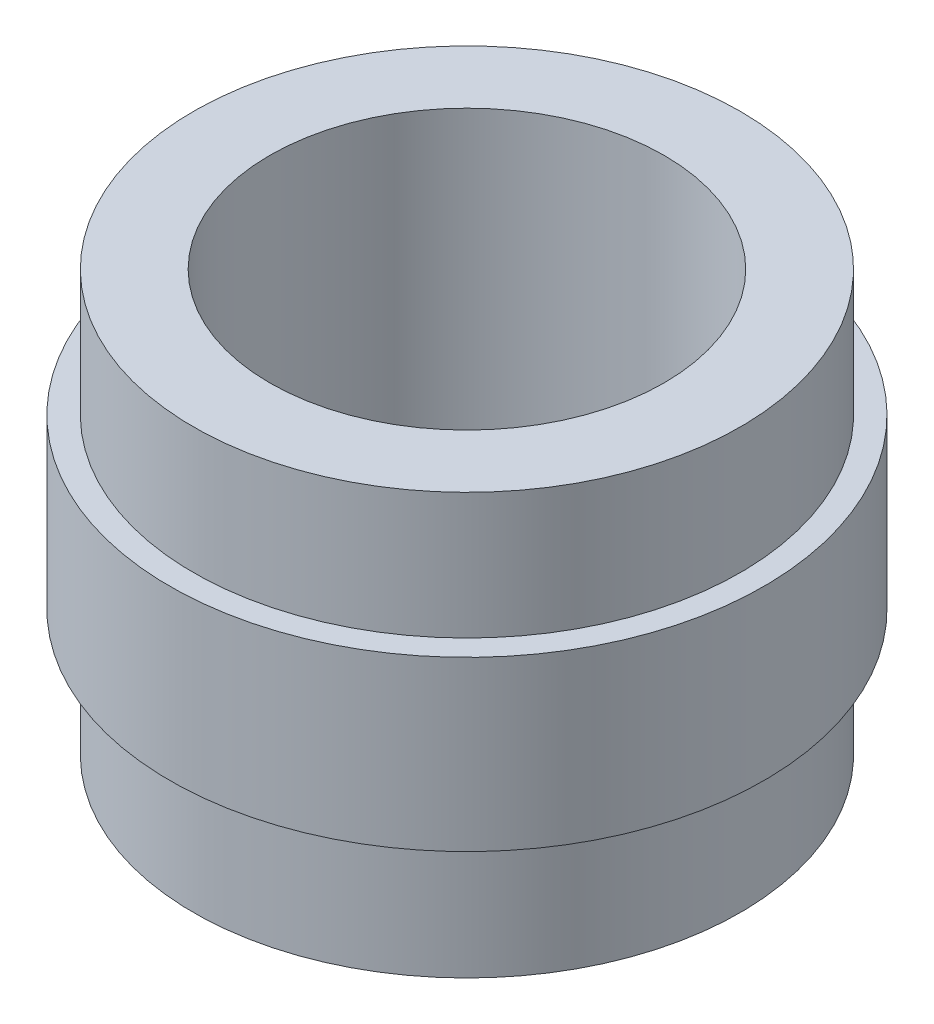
from build123d import *


with BuildPart() as part:
    # Esquisse1 → R_volution1 (revolve)
    with BuildSketch(Plane.XY, mode=Mode.PRIVATE) as r_volution1_sk:
        Polygon((1.875, 0), (2.6, 0), (2.6, 1.2), (2.825, 1.2), (2.825, 2.8), (2.6, 2.8), (2.6, 4), (1.875, 4), align=None)
    revolve(r_volution1_sk.sketch.rotate(Axis((0, 0, 0), (0, 1, 0)), 90), axis=Axis((0, 0, 0), (0, 1, 0)))


solid = part.part
